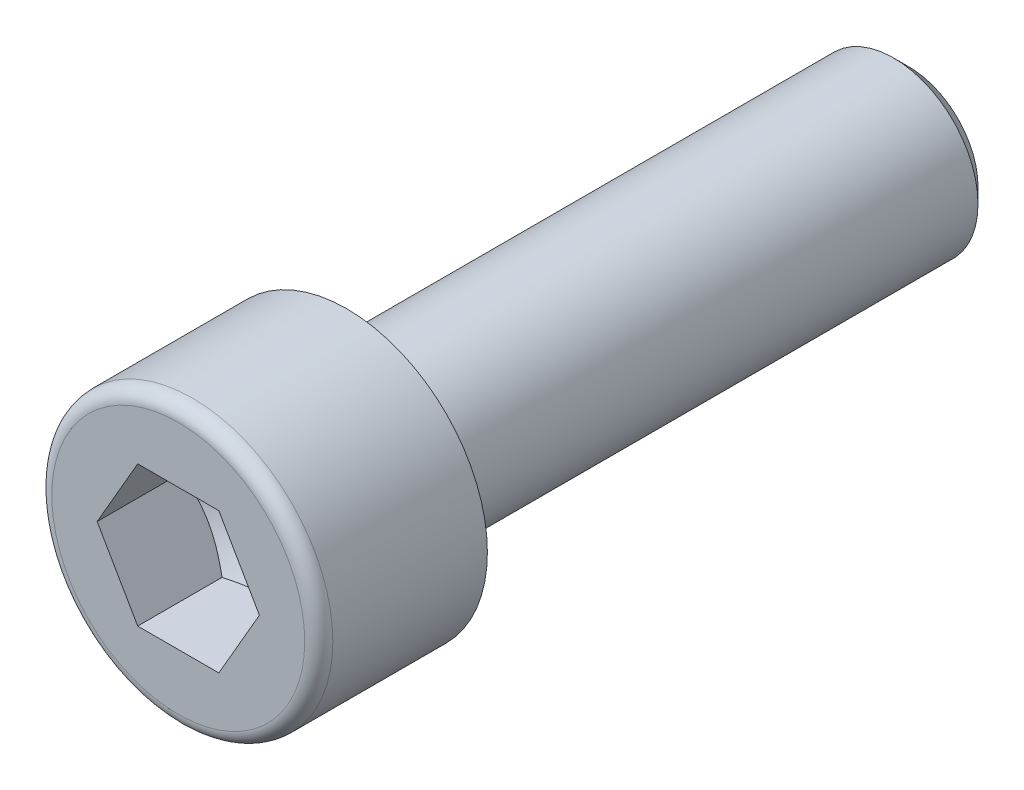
ISO-10303-21;
HEADER;
FILE_DESCRIPTION(('STEP AP214'),'2;1');
FILE_NAME('part.step','',(''),(''),'','','');
FILE_SCHEMA(('AUTOMOTIVE_DESIGN { 1 0 10303 214 1 1 1 1 }'));
ENDSEC;
DATA;
#1=APPLICATION_CONTEXT('core data for automotive mechanical design processes');
#2=APPLICATION_PROTOCOL_DEFINITION('international standard','automotive_design',2000,#1);
#3=PRODUCT_CONTEXT('',#1,'mechanical');
#4=PRODUCT('Part','Part','',(#3));
#5=PRODUCT_RELATED_PRODUCT_CATEGORY('part','',(#4));
#6=PRODUCT_DEFINITION_FORMATION('','',#4);
#7=PRODUCT_DEFINITION_CONTEXT('part definition',#1,'design');
#8=PRODUCT_DEFINITION('design','',#6,#7);
#9=PRODUCT_DEFINITION_SHAPE('','',#8);
#10=(LENGTH_UNIT() NAMED_UNIT(*) SI_UNIT(.MILLI.,.METRE.));
#11=(NAMED_UNIT(*) PLANE_ANGLE_UNIT() SI_UNIT($,.RADIAN.));
#12=(NAMED_UNIT(*) SI_UNIT($,.STERADIAN.) SOLID_ANGLE_UNIT());
#13=UNCERTAINTY_MEASURE_WITH_UNIT(LENGTH_MEASURE(1.E-05),#10,'distance_accuracy_value','');
#14=(GEOMETRIC_REPRESENTATION_CONTEXT(3) GLOBAL_UNCERTAINTY_ASSIGNED_CONTEXT((#13)) GLOBAL_UNIT_ASSIGNED_CONTEXT((#10,
#11,#12)) REPRESENTATION_CONTEXT('',''));
#15=CARTESIAN_POINT('',(0.,0.,0.));
#16=DIRECTION('',(0.,0.,1.));
#17=DIRECTION('',(1.,0.,0.));
#18=AXIS2_PLACEMENT_3D('',#15,#16,#17);
#19=CARTESIAN_POINT('',(0.,0.,6.));
#20=DIRECTION('',(0.,0.,1.));
#21=DIRECTION('',(1.,0.,0.));
#22=AXIS2_PLACEMENT_3D('',#19,#20,#21);
#23=PLANE('',#22);
#24=CARTESIAN_POINT('',(0.,0.,6.));
#25=DIRECTION('',(0.,0.,1.));
#26=DIRECTION('',(1.,0.,0.));
#27=AXIS2_PLACEMENT_3D('',#24,#25,#26);
#28=CIRCLE('',#27,4.5);
#29=CARTESIAN_POINT('',(4.5,0.,6.));
#30=VERTEX_POINT('',#29);
#31=EDGE_CURVE('E11',#30,#30,#28,.T.);
#32=ORIENTED_EDGE('',*,*,#31,.T.);
#33=EDGE_LOOP('',(#32));
#34=FACE_BOUND('',#33,.T.);
#35=DIRECTION('',(1.,0.,0.));
#36=VECTOR('',#35,1.);
#37=CARTESIAN_POINT('',(-1.443375,2.49999883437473,6.));
#38=LINE('',#37,#36);
#39=CARTESIAN_POINT('',(-1.443375,2.49999883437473,6.));
#40=VERTEX_POINT('',#39);
#41=CARTESIAN_POINT('',(1.443375,2.49999883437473,6.));
#42=VERTEX_POINT('',#41);
#43=EDGE_CURVE('E91',#40,#42,#38,.T.);
#44=ORIENTED_EDGE('',*,*,#43,.T.);
#45=DIRECTION('',(0.5,-0.866025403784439,0.));
#46=VECTOR('',#45,1.);
#47=CARTESIAN_POINT('',(1.443375,2.49999883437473,6.));
#48=LINE('',#47,#46);
#49=CARTESIAN_POINT('',(2.88675,0.,6.));
#50=VERTEX_POINT('',#49);
#51=EDGE_CURVE('E30',#42,#50,#48,.T.);
#52=ORIENTED_EDGE('',*,*,#51,.T.);
#53=DIRECTION('',(-0.5,-0.866025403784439,0.));
#54=VECTOR('',#53,1.);
#55=CARTESIAN_POINT('',(2.88675,0.,6.));
#56=LINE('',#55,#54);
#57=CARTESIAN_POINT('',(1.443375,-2.49999883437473,6.));
#58=VERTEX_POINT('',#57);
#59=EDGE_CURVE('E171',#50,#58,#56,.T.);
#60=ORIENTED_EDGE('',*,*,#59,.T.);
#61=DIRECTION('',(-1.,0.,0.));
#62=VECTOR('',#61,1.);
#63=CARTESIAN_POINT('',(1.443375,-2.49999883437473,6.));
#64=LINE('',#63,#62);
#65=CARTESIAN_POINT('',(-1.443375,-2.49999883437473,6.));
#66=VERTEX_POINT('',#65);
#67=EDGE_CURVE('E167',#58,#66,#64,.T.);
#68=ORIENTED_EDGE('',*,*,#67,.T.);
#69=DIRECTION('',(-0.5,0.866025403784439,0.));
#70=VECTOR('',#69,1.);
#71=CARTESIAN_POINT('',(-1.443375,-2.49999883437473,6.));
#72=LINE('',#71,#70);
#73=CARTESIAN_POINT('',(-2.88675,0.,6.));
#74=VERTEX_POINT('',#73);
#75=EDGE_CURVE('E162',#66,#74,#72,.T.);
#76=ORIENTED_EDGE('',*,*,#75,.T.);
#77=DIRECTION('',(0.5,0.866025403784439,0.));
#78=VECTOR('',#77,1.);
#79=CARTESIAN_POINT('',(-2.88675,0.,6.));
#80=LINE('',#79,#78);
#81=EDGE_CURVE('E95',#74,#40,#80,.T.);
#82=ORIENTED_EDGE('',*,*,#81,.T.);
#83=EDGE_LOOP('',(#44,#52,#60,#68,#76,#82));
#84=FACE_BOUND('',#83,.T.);
#85=ADVANCED_FACE('F16',(#34,#84),#23,.T.);
#86=CARTESIAN_POINT('',(0.,0.,5.5));
#87=DIRECTION('',(0.,0.,1.));
#88=DIRECTION('',(1.,0.,0.));
#89=AXIS2_PLACEMENT_3D('',#86,#87,#88);
#90=TOROIDAL_SURFACE('',#89,4.5,0.5);
#91=ORIENTED_EDGE('',*,*,#31,.F.);
#92=EDGE_LOOP('',(#91));
#93=FACE_BOUND('',#92,.T.);
#94=CARTESIAN_POINT('',(0.,0.,5.5));
#95=DIRECTION('',(0.,0.,1.));
#96=DIRECTION('',(1.,0.,0.));
#97=AXIS2_PLACEMENT_3D('',#94,#95,#96);
#98=CIRCLE('',#97,5.);
#99=CARTESIAN_POINT('',(5.,0.,5.5));
#100=VERTEX_POINT('',#99);
#101=EDGE_CURVE('E23',#100,#100,#98,.T.);
#102=ORIENTED_EDGE('',*,*,#101,.T.);
#103=EDGE_LOOP('',(#102));
#104=FACE_BOUND('',#103,.T.);
#105=ADVANCED_FACE('F132',(#93,#104),#90,.T.);
#106=CARTESIAN_POINT('',(0.,0.,6.));
#107=DIRECTION('',(0.,0.,1.));
#108=DIRECTION('',(1.,0.,0.));
#109=AXIS2_PLACEMENT_3D('',#106,#107,#108);
#110=CYLINDRICAL_SURFACE('',#109,5.);
#111=CARTESIAN_POINT('',(0.,0.,0.));
#112=DIRECTION('',(0.,0.,1.));
#113=DIRECTION('',(1.,0.,0.));
#114=AXIS2_PLACEMENT_3D('',#111,#112,#113);
#115=CIRCLE('',#114,5.);
#116=CARTESIAN_POINT('',(5.,0.,0.));
#117=VERTEX_POINT('',#116);
#118=EDGE_CURVE('E127',#117,#117,#115,.T.);
#119=ORIENTED_EDGE('',*,*,#118,.T.);
#120=EDGE_LOOP('',(#119));
#121=FACE_BOUND('',#120,.T.);
#122=ORIENTED_EDGE('',*,*,#101,.F.);
#123=EDGE_LOOP('',(#122));
#124=FACE_BOUND('',#123,.T.);
#125=ADVANCED_FACE('F134',(#121,#124),#110,.T.);
#126=CARTESIAN_POINT('',(0.,5.,0.));
#127=DIRECTION('',(0.,0.,-1.));
#128=DIRECTION('',(-1.,0.,0.));
#129=AXIS2_PLACEMENT_3D('',#126,#127,#128);
#130=PLANE('',#129);
#131=CARTESIAN_POINT('',(0.,0.,0.));
#132=DIRECTION('',(0.,0.,1.));
#133=DIRECTION('',(1.,0.,0.));
#134=AXIS2_PLACEMENT_3D('',#131,#132,#133);
#135=CIRCLE('',#134,3.3);
#136=CARTESIAN_POINT('',(3.3,0.,0.));
#137=VERTEX_POINT('',#136);
#138=EDGE_CURVE('E124',#137,#137,#135,.T.);
#139=ORIENTED_EDGE('',*,*,#138,.T.);
#140=EDGE_LOOP('',(#139));
#141=FACE_BOUND('',#140,.T.);
#142=ORIENTED_EDGE('',*,*,#118,.F.);
#143=EDGE_LOOP('',(#142));
#144=FACE_BOUND('',#143,.T.);
#145=ADVANCED_FACE('F136',(#141,#144),#130,.T.);
#146=CARTESIAN_POINT('',(0.,0.,-0.3));
#147=DIRECTION('',(0.,0.,1.));
#148=DIRECTION('',(1.,0.,0.));
#149=AXIS2_PLACEMENT_3D('',#146,#147,#148);
#150=TOROIDAL_SURFACE('',#149,3.3,0.3);
#151=CARTESIAN_POINT('',(0.,0.,-0.3));
#152=DIRECTION('',(0.,0.,1.));
#153=DIRECTION('',(1.,0.,0.));
#154=AXIS2_PLACEMENT_3D('',#151,#152,#153);
#155=CIRCLE('',#154,3.);
#156=CARTESIAN_POINT('',(3.,0.,-0.3));
#157=VERTEX_POINT('',#156);
#158=EDGE_CURVE('E121',#157,#157,#155,.T.);
#159=ORIENTED_EDGE('',*,*,#158,.T.);
#160=EDGE_LOOP('',(#159));
#161=FACE_BOUND('',#160,.T.);
#162=ORIENTED_EDGE('',*,*,#138,.F.);
#163=EDGE_LOOP('',(#162));
#164=FACE_BOUND('',#163,.T.);
#165=ADVANCED_FACE('F144',(#161,#164),#150,.F.);
#166=CARTESIAN_POINT('',(0.,0.,6.));
#167=DIRECTION('',(0.,0.,1.));
#168=DIRECTION('',(1.,0.,0.));
#169=AXIS2_PLACEMENT_3D('',#166,#167,#168);
#170=CYLINDRICAL_SURFACE('',#169,3.);
#171=CARTESIAN_POINT('',(0.,0.,-0.301));
#172=DIRECTION('',(0.,0.,1.));
#173=DIRECTION('',(1.,0.,0.));
#174=AXIS2_PLACEMENT_3D('',#171,#172,#173);
#175=CIRCLE('',#174,3.);
#176=CARTESIAN_POINT('',(3.,0.,-0.301));
#177=VERTEX_POINT('',#176);
#178=EDGE_CURVE('E118',#177,#177,#175,.T.);
#179=ORIENTED_EDGE('',*,*,#178,.T.);
#180=EDGE_LOOP('',(#179));
#181=FACE_BOUND('',#180,.T.);
#182=ORIENTED_EDGE('',*,*,#158,.F.);
#183=EDGE_LOOP('',(#182));
#184=FACE_BOUND('',#183,.T.);
#185=ADVANCED_FACE('F289',(#181,#184),#170,.T.);
#186=CARTESIAN_POINT('',(0.,0.,-0.301));
#187=DIRECTION('',(0.,0.,1.));
#188=DIRECTION('',(1.,0.,0.));
#189=AXIS2_PLACEMENT_3D('',#186,#187,#188);
#190=CONICAL_SURFACE('',#189,3.,0.523598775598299);
#191=CARTESIAN_POINT('',(0.,0.,-1.23847249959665));
#192=DIRECTION('',(0.,0.,1.));
#193=DIRECTION('',(1.,0.,0.));
#194=AXIS2_PLACEMENT_3D('',#191,#192,#193);
#195=CIRCLE('',#194,2.45875);
#196=CARTESIAN_POINT('',(2.45875,0.,-1.23847249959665));
#197=VERTEX_POINT('',#196);
#198=EDGE_CURVE('E115',#197,#197,#195,.T.);
#199=ORIENTED_EDGE('',*,*,#198,.T.);
#200=EDGE_LOOP('',(#199));
#201=FACE_BOUND('',#200,.T.);
#202=ORIENTED_EDGE('',*,*,#178,.F.);
#203=EDGE_LOOP('',(#202));
#204=FACE_BOUND('',#203,.T.);
#205=ADVANCED_FACE('F280',(#201,#204),#190,.T.);
#206=CARTESIAN_POINT('',(0.,2.45875,-1.23847249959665));
#207=DIRECTION('',(0.,0.,1.));
#208=DIRECTION('',(1.,0.,0.));
#209=AXIS2_PLACEMENT_3D('',#206,#207,#208);
#210=PLANE('',#209);
#211=CARTESIAN_POINT('',(0.,0.,-1.23847249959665));
#212=DIRECTION('',(0.,0.,1.));
#213=DIRECTION('',(1.,0.,0.));
#214=AXIS2_PLACEMENT_3D('',#211,#212,#213);
#215=CIRCLE('',#214,3.);
#216=CARTESIAN_POINT('',(3.,0.,-1.23847249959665));
#217=VERTEX_POINT('',#216);
#218=EDGE_CURVE('E112',#217,#217,#215,.T.);
#219=ORIENTED_EDGE('',*,*,#218,.T.);
#220=EDGE_LOOP('',(#219));
#221=FACE_BOUND('',#220,.T.);
#222=ORIENTED_EDGE('',*,*,#198,.F.);
#223=EDGE_LOOP('',(#222));
#224=FACE_BOUND('',#223,.T.);
#225=ADVANCED_FACE('F271',(#221,#224),#210,.T.);
#226=CARTESIAN_POINT('',(0.,0.,6.));
#227=DIRECTION('',(0.,0.,1.));
#228=DIRECTION('',(1.,0.,0.));
#229=AXIS2_PLACEMENT_3D('',#226,#227,#228);
#230=CYLINDRICAL_SURFACE('',#229,3.);
#231=CARTESIAN_POINT('',(0.,0.,-19.45875));
#232=DIRECTION('',(0.,0.,1.));
#233=DIRECTION('',(1.,0.,0.));
#234=AXIS2_PLACEMENT_3D('',#231,#232,#233);
#235=CIRCLE('',#234,3.);
#236=CARTESIAN_POINT('',(3.,0.,-19.45875));
#237=VERTEX_POINT('',#236);
#238=EDGE_CURVE('E109',#237,#237,#235,.T.);
#239=ORIENTED_EDGE('',*,*,#238,.T.);
#240=EDGE_LOOP('',(#239));
#241=FACE_BOUND('',#240,.T.);
#242=ORIENTED_EDGE('',*,*,#218,.F.);
#243=EDGE_LOOP('',(#242));
#244=FACE_BOUND('',#243,.T.);
#245=ADVANCED_FACE('F262',(#241,#244),#230,.T.);
#246=CARTESIAN_POINT('',(0.,0.,-19.45875));
#247=DIRECTION('',(0.,0.,1.));
#248=DIRECTION('',(1.,0.,0.));
#249=AXIS2_PLACEMENT_3D('',#246,#247,#248);
#250=CONICAL_SURFACE('',#249,3.,0.78539816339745);
#251=CARTESIAN_POINT('',(0.,0.,-20.));
#252=DIRECTION('',(0.,0.,1.));
#253=DIRECTION('',(1.,0.,0.));
#254=AXIS2_PLACEMENT_3D('',#251,#252,#253);
#255=CIRCLE('',#254,2.45875);
#256=CARTESIAN_POINT('',(2.45875,0.,-20.));
#257=VERTEX_POINT('',#256);
#258=EDGE_CURVE('E106',#257,#257,#255,.T.);
#259=ORIENTED_EDGE('',*,*,#258,.T.);
#260=EDGE_LOOP('',(#259));
#261=FACE_BOUND('',#260,.T.);
#262=ORIENTED_EDGE('',*,*,#238,.F.);
#263=EDGE_LOOP('',(#262));
#264=FACE_BOUND('',#263,.T.);
#265=ADVANCED_FACE('F254',(#261,#264),#250,.T.);
#266=CARTESIAN_POINT('',(0.,2.45875,-20.));
#267=DIRECTION('',(0.,0.,-1.));
#268=DIRECTION('',(-1.,0.,0.));
#269=AXIS2_PLACEMENT_3D('',#266,#267,#268);
#270=PLANE('',#269);
#271=ORIENTED_EDGE('',*,*,#258,.F.);
#272=EDGE_LOOP('',(#271));
#273=FACE_BOUND('',#272,.T.);
#274=ADVANCED_FACE('F227',(#273),#270,.T.);
#275=CARTESIAN_POINT('',(1.443375,2.49999883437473,1.33333411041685));
#276=DIRECTION('',(-0.866025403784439,-0.5,0.));
#277=DIRECTION('',(-0.5,0.866025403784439,0.));
#278=AXIS2_PLACEMENT_3D('',#275,#276,#277);
#279=PLANE('',#278);
#280=DIRECTION('',(0.,0.,1.));
#281=VECTOR('',#280,1.);
#282=CARTESIAN_POINT('',(2.88675,0.,1.33333411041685));
#283=LINE('',#282,#281);
#284=CARTESIAN_POINT('',(2.88675,0.,3.));
#285=VERTEX_POINT('',#284);
#286=EDGE_CURVE('E104',#285,#50,#283,.T.);
#287=ORIENTED_EDGE('',*,*,#286,.T.);
#288=ORIENTED_EDGE('',*,*,#51,.F.);
#289=DIRECTION('',(0.,0.,1.));
#290=VECTOR('',#289,1.);
#291=CARTESIAN_POINT('',(1.443375,2.49999883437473,1.33333411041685));
#292=LINE('',#291,#290);
#293=CARTESIAN_POINT('',(1.443375,2.49999883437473,3.));
#294=VERTEX_POINT('',#293);
#295=EDGE_CURVE('E85',#294,#42,#292,.T.);
#296=ORIENTED_EDGE('',*,*,#295,.F.);
#297=CARTESIAN_POINT('',(2.88675011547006,-1.99999999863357E-07,3.00000006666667));
#298=CARTESIAN_POINT('',(2.82332252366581,0.10985961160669,2.96336950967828));
#299=CARTESIAN_POINT('',(2.75934742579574,0.220667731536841,2.93005593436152));
#300=CARTESIAN_POINT('',(2.63028954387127,0.444202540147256,2.87190808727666));
#301=CARTESIAN_POINT('',(2.56520446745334,0.556933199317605,2.84709438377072));
#302=CARTESIAN_POINT('',(2.43584088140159,0.780997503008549,2.80847006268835));
#303=CARTESIAN_POINT('',(2.37158227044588,0.892296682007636,2.7944023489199));
#304=CARTESIAN_POINT('',(2.24276284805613,1.11541846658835,2.77761157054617));
#305=CARTESIAN_POINT('',(2.17820250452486,1.22724026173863,2.77487459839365));
#306=CARTESIAN_POINT('',(2.05757841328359,1.43616731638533,2.78058295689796));
#307=CARTESIAN_POINT('',(2.00149656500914,1.53330392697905,2.7876266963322));
#308=CARTESIAN_POINT('',(1.8896982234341,1.72694433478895,2.80994670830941));
#309=CARTESIAN_POINT('',(1.83398211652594,1.82344746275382,2.82523059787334));
#310=CARTESIAN_POINT('',(1.72195345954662,2.01748678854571,2.86343736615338));
#311=CARTESIAN_POINT('',(1.66565508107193,2.11499844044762,2.88652212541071));
#312=CARTESIAN_POINT('',(1.55389777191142,2.3085677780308,2.93891477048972));
#313=CARTESIAN_POINT('',(1.49843741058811,2.40462794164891,2.96821035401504));
#314=CARTESIAN_POINT('',(1.44337488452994,2.49999903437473,3.00000006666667));
#315=B_SPLINE_CURVE_WITH_KNOTS('',3,(#297,#298,#299,#300,#301,#302,#303,#304,#305,#306,#307,
#308,#309,#310,#311,#312,#313,#314),.UNSPECIFIED.,.F.,.F.,(4,2,2,2,2,2,2,2,4),(0.,
0.396269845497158,0.793491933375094,1.18088400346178,1.56780044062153,1.90463400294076,
2.24177946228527,2.58640119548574,2.93034658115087),.UNSPECIFIED.);
#316=EDGE_CURVE('E78',#285,#294,#315,.T.);
#317=ORIENTED_EDGE('',*,*,#316,.F.);
#318=EDGE_LOOP('',(#287,#288,#296,#317));
#319=FACE_BOUND('',#318,.T.);
#320=ADVANCED_FACE('F86',(#319),#279,.T.);
#321=CARTESIAN_POINT('',(2.88675,0.,1.33333411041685));
#322=DIRECTION('',(-0.866025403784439,0.5,0.));
#323=DIRECTION('',(0.5,0.866025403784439,0.));
#324=AXIS2_PLACEMENT_3D('',#321,#322,#323);
#325=PLANE('',#324);
#326=DIRECTION('',(0.,0.,1.));
#327=VECTOR('',#326,1.);
#328=CARTESIAN_POINT('',(1.443375,-2.49999883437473,1.33333411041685));
#329=LINE('',#328,#327);
#330=CARTESIAN_POINT('',(1.443375,-2.49999883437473,3.));
#331=VERTEX_POINT('',#330);
#332=EDGE_CURVE('E102',#331,#58,#329,.T.);
#333=ORIENTED_EDGE('',*,*,#332,.T.);
#334=ORIENTED_EDGE('',*,*,#59,.F.);
#335=ORIENTED_EDGE('',*,*,#286,.F.);
#336=CARTESIAN_POINT('',(1.44337488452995,-2.49999903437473,3.00000006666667));
#337=CARTESIAN_POINT('',(1.50680247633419,-2.39013922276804,2.96336950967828));
#338=CARTESIAN_POINT('',(1.57077757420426,-2.27933110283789,2.93005593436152));
#339=CARTESIAN_POINT('',(1.69983545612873,-2.05579629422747,2.87190808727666));
#340=CARTESIAN_POINT('',(1.76492053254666,-1.94306563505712,2.84709438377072));
#341=CARTESIAN_POINT('',(1.89428411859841,-1.71900133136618,2.80847006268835));
#342=CARTESIAN_POINT('',(1.95854272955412,-1.60770215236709,2.7944023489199));
#343=CARTESIAN_POINT('',(2.08736215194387,-1.38458036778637,2.77761157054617));
#344=CARTESIAN_POINT('',(2.15192249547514,-1.2727585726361,2.77487459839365));
#345=CARTESIAN_POINT('',(2.27254658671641,-1.06383151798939,2.78058295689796));
#346=CARTESIAN_POINT('',(2.32862843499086,-0.96669490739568,2.7876266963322));
#347=CARTESIAN_POINT('',(2.4404267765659,-0.773054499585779,2.8099467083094));
#348=CARTESIAN_POINT('',(2.49614288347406,-0.676551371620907,2.82523059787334));
#349=CARTESIAN_POINT('',(2.60817154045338,-0.48251204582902,2.86343736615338));
#350=CARTESIAN_POINT('',(2.66446991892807,-0.385000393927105,2.88652212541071));
#351=CARTESIAN_POINT('',(2.77622722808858,-0.191431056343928,2.93891477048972));
#352=CARTESIAN_POINT('',(2.83168758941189,-0.0953708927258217,2.96821035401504));
#353=CARTESIAN_POINT('',(2.88675011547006,1.99999999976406E-07,3.00000006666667));
#354=B_SPLINE_CURVE_WITH_KNOTS('',3,(#336,#337,#338,#339,#340,#341,#342,#343,#344,#345,#346,
#347,#348,#349,#350,#351,#352,#353),.UNSPECIFIED.,.F.,.F.,(4,2,2,2,2,2,2,2,4),(0.,
0.396269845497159,0.793491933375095,1.18088400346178,1.56780044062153,1.90463400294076,
2.24177946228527,2.58640119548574,2.93034658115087),.UNSPECIFIED.);
#355=EDGE_CURVE('E82',#331,#285,#354,.T.);
#356=ORIENTED_EDGE('',*,*,#355,.F.);
#357=EDGE_LOOP('',(#333,#334,#335,#356));
#358=FACE_BOUND('',#357,.T.);
#359=ADVANCED_FACE('F217',(#358),#325,.T.);
#360=CARTESIAN_POINT('',(1.443375,-2.49999883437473,1.33333411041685));
#361=DIRECTION('',(0.,1.,0.));
#362=DIRECTION('',(1.,0.,0.));
#363=AXIS2_PLACEMENT_3D('',#360,#361,#362);
#364=PLANE('',#363);
#365=DIRECTION('',(0.,0.,1.));
#366=VECTOR('',#365,1.);
#367=CARTESIAN_POINT('',(-1.443375,-2.49999883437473,1.33333411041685));
#368=LINE('',#367,#366);
#369=CARTESIAN_POINT('',(-1.443375,-2.49999883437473,3.));
#370=VERTEX_POINT('',#369);
#371=EDGE_CURVE('E100',#370,#66,#368,.T.);
#372=ORIENTED_EDGE('',*,*,#371,.T.);
#373=ORIENTED_EDGE('',*,*,#67,.F.);
#374=ORIENTED_EDGE('',*,*,#332,.F.);
#375=CARTESIAN_POINT('',(-3.73786106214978,-2.49999883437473,3.92958778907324));
#376=CARTESIAN_POINT('',(-3.62896491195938,-2.49999883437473,3.87734398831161));
#377=CARTESIAN_POINT('',(-3.51980131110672,-2.49999883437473,3.82564701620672));
#378=CARTESIAN_POINT('',(-3.30079453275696,-2.49999883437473,3.72366066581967));
#379=CARTESIAN_POINT('',(-3.19095123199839,-2.49999883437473,3.67337155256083));
#380=CARTESIAN_POINT('',(-2.96980741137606,-2.49999883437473,3.57423266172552));
#381=CARTESIAN_POINT('',(-2.85850208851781,-2.49999883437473,3.5253935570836));
#382=CARTESIAN_POINT('',(-2.63494533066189,-2.49999883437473,3.42993961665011));
#383=CARTESIAN_POINT('',(-2.52269394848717,-2.49999883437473,3.38332465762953));
#384=CARTESIAN_POINT('',(-2.2960796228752,-2.49999883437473,3.29252281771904));
#385=CARTESIAN_POINT('',(-2.18170681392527,-2.49999883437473,3.2483604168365));
#386=CARTESIAN_POINT('',(-1.95158478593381,-2.49999883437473,3.16370836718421));
#387=CARTESIAN_POINT('',(-1.83583541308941,-2.49999883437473,3.12321913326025));
#388=CARTESIAN_POINT('',(-1.60304799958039,-2.49999883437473,3.04706130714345));
#389=CARTESIAN_POINT('',(-1.4860136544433,-2.49999883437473,3.01138153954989));
#390=CARTESIAN_POINT('',(-1.25028155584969,-2.49999883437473,2.94604587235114));
#391=CARTESIAN_POINT('',(-1.13158421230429,-2.49999883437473,2.91638851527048));
#392=CARTESIAN_POINT('',(-0.892146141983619,-2.49999883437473,2.86451911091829));
#393=CARTESIAN_POINT('',(-0.771400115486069,-2.49999883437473,2.84233105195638));
#394=CARTESIAN_POINT('',(-0.528550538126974,-2.49999883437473,2.8070567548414));
#395=CARTESIAN_POINT('',(-0.406446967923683,-2.49999883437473,2.7939706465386));
#396=CARTESIAN_POINT('',(-0.162227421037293,-2.49999883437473,2.77805851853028));
#397=CARTESIAN_POINT('',(-0.0401151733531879,-2.49999883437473,2.77517671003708));
#398=CARTESIAN_POINT('',(0.203885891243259,-2.49999883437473,2.77978959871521));
#399=CARTESIAN_POINT('',(0.325774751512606,-2.49999883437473,2.78728200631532));
#400=CARTESIAN_POINT('',(0.536617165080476,-2.49999883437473,2.80870547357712));
#401=CARTESIAN_POINT('',(0.625806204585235,-2.49999883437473,2.82042640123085));
#402=CARTESIAN_POINT('',(0.803437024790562,-2.49999883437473,2.84861382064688));
#403=CARTESIAN_POINT('',(0.891878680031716,-2.49999883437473,2.86508109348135));
#404=CARTESIAN_POINT('',(1.1562492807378,-2.49999883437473,2.92077504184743));
#405=CARTESIAN_POINT('',(1.3308708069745,-2.49999883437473,2.96625356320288));
#406=CARTESIAN_POINT('',(1.59190160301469,-2.49999883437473,3.04393162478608));
#407=CARTESIAN_POINT('',(1.67969059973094,-2.49999883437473,3.0717495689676));
#408=CARTESIAN_POINT('',(1.85442096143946,-2.49999883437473,3.12997740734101));
#409=CARTESIAN_POINT('',(1.94136225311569,-2.49999883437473,3.16038752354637));
#410=CARTESIAN_POINT('',(2.1139610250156,-2.49999883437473,3.22316216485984));
#411=CARTESIAN_POINT('',(2.19962301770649,-2.49999883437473,3.25551440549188));
#412=CARTESIAN_POINT('',(2.37023194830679,-2.49999883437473,3.32197432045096));
#413=CARTESIAN_POINT('',(2.45517911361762,-2.49999883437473,3.35608140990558));
#414=CARTESIAN_POINT('',(2.53982745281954,-2.49999883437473,3.3908988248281));
#415=B_SPLINE_CURVE_WITH_KNOTS('',3,(#375,#376,#377,#378,#379,#380,#381,#382,#383,#384,#385,
#386,#387,#388,#389,#390,#391,#392,#393,#394,#395,#396,#397,#398,#399,#400,#401,#402,#403,#404,
#405,#406,#407,#408,#409,#410,#411,#412,#413,#414),.UNSPECIFIED.,.F.,.F.,(4,2,2,2,2,2,2,2,2,2,2,
2,2,2,2,2,2,2,2,4),(0.,0.362345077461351,0.724757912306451,1.08938530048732,1.45399246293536,
1.82175226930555,2.18955355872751,2.55648491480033,2.92332736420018,3.29133696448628,
3.65935181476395,4.02535152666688,4.39127047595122,4.66100477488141,4.93078348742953,
5.47140222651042,5.74765583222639,6.02393312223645,6.29861688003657,6.57320967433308),.UNSPECIFIED.);
#416=EDGE_CURVE('E209',#370,#331,#415,.T.);
#417=ORIENTED_EDGE('',*,*,#416,.F.);
#418=EDGE_LOOP('',(#372,#373,#374,#417));
#419=FACE_BOUND('',#418,.T.);
#420=ADVANCED_FACE('F214',(#419),#364,.T.);
#421=CARTESIAN_POINT('',(-1.443375,-2.49999883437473,1.33333411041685));
#422=DIRECTION('',(0.866025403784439,0.5,0.));
#423=DIRECTION('',(0.5,-0.866025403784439,0.));
#424=AXIS2_PLACEMENT_3D('',#421,#422,#423);
#425=PLANE('',#424);
#426=DIRECTION('',(0.,0.,1.));
#427=VECTOR('',#426,1.);
#428=CARTESIAN_POINT('',(-2.88675,0.,1.33333411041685));
#429=LINE('',#428,#427);
#430=CARTESIAN_POINT('',(-2.88675,0.,3.));
#431=VERTEX_POINT('',#430);
#432=EDGE_CURVE('E93',#431,#74,#429,.T.);
#433=ORIENTED_EDGE('',*,*,#432,.T.);
#434=ORIENTED_EDGE('',*,*,#75,.F.);
#435=ORIENTED_EDGE('',*,*,#371,.F.);
#436=CARTESIAN_POINT('',(-2.88675011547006,2.E-07,3.00000006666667));
#437=CARTESIAN_POINT('',(-2.82332252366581,-0.109859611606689,2.96336950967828));
#438=CARTESIAN_POINT('',(-2.75934742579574,-0.220667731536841,2.93005593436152));
#439=CARTESIAN_POINT('',(-2.63028954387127,-0.444202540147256,2.87190808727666));
#440=CARTESIAN_POINT('',(-2.56520446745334,-0.556933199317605,2.84709438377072));
#441=CARTESIAN_POINT('',(-2.43584088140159,-0.78099750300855,2.80847006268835));
#442=CARTESIAN_POINT('',(-2.37158227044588,-0.892296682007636,2.7944023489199));
#443=CARTESIAN_POINT('',(-2.24276284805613,-1.11541846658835,2.77761157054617));
#444=CARTESIAN_POINT('',(-2.17820250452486,-1.22724026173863,2.77487459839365));
#445=CARTESIAN_POINT('',(-2.05757841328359,-1.43616731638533,2.78058295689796));
#446=CARTESIAN_POINT('',(-2.00149656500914,-1.53330392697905,2.7876266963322));
#447=CARTESIAN_POINT('',(-1.8896982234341,-1.72694433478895,2.80994670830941));
#448=CARTESIAN_POINT('',(-1.83398211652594,-1.82344746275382,2.82523059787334));
#449=CARTESIAN_POINT('',(-1.72195345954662,-2.01748678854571,2.86343736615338));
#450=CARTESIAN_POINT('',(-1.66565508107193,-2.11499844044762,2.88652212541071));
#451=CARTESIAN_POINT('',(-1.55389777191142,-2.3085677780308,2.93891477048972));
#452=CARTESIAN_POINT('',(-1.49843741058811,-2.40462794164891,2.96821035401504));
#453=CARTESIAN_POINT('',(-1.44337488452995,-2.49999903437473,3.00000006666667));
#454=B_SPLINE_CURVE_WITH_KNOTS('',3,(#436,#437,#438,#439,#440,#441,#442,#443,#444,#445,#446,
#447,#448,#449,#450,#451,#452,#453),.UNSPECIFIED.,.F.,.F.,(4,2,2,2,2,2,2,2,4),(0.,
0.396269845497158,0.793491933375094,1.18088400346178,1.56780044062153,1.90463400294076,
2.24177946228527,2.58640119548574,2.93034658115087),.UNSPECIFIED.);
#455=EDGE_CURVE('E204',#431,#370,#454,.T.);
#456=ORIENTED_EDGE('',*,*,#455,.F.);
#457=EDGE_LOOP('',(#433,#434,#435,#456));
#458=FACE_BOUND('',#457,.T.);
#459=ADVANCED_FACE('F216',(#458),#425,.T.);
#460=CARTESIAN_POINT('',(-2.88675,0.,1.33333411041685));
#461=DIRECTION('',(0.866025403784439,-0.5,0.));
#462=DIRECTION('',(-0.5,-0.866025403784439,0.));
#463=AXIS2_PLACEMENT_3D('',#460,#461,#462);
#464=PLANE('',#463);
#465=DIRECTION('',(0.,0.,1.));
#466=VECTOR('',#465,1.);
#467=CARTESIAN_POINT('',(-1.443375,2.49999883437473,1.33333411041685));
#468=LINE('',#467,#466);
#469=CARTESIAN_POINT('',(-1.443375,2.49999883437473,3.));
#470=VERTEX_POINT('',#469);
#471=EDGE_CURVE('E90',#470,#40,#468,.T.);
#472=ORIENTED_EDGE('',*,*,#471,.T.);
#473=ORIENTED_EDGE('',*,*,#81,.F.);
#474=ORIENTED_EDGE('',*,*,#432,.F.);
#475=CARTESIAN_POINT('',(-1.44337488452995,2.49999903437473,3.00000006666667));
#476=CARTESIAN_POINT('',(-1.50680247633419,2.39013922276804,2.96336950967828));
#477=CARTESIAN_POINT('',(-1.57077757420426,2.27933110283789,2.93005593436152));
#478=CARTESIAN_POINT('',(-1.69983545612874,2.05579629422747,2.87190808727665));
#479=CARTESIAN_POINT('',(-1.76492053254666,1.94306563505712,2.84709438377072));
#480=CARTESIAN_POINT('',(-1.89428411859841,1.71900133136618,2.80847006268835));
#481=CARTESIAN_POINT('',(-1.95854272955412,1.60770215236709,2.7944023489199));
#482=CARTESIAN_POINT('',(-2.08736215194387,1.38458036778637,2.77761157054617));
#483=CARTESIAN_POINT('',(-2.15192249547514,1.2727585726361,2.77487459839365));
#484=CARTESIAN_POINT('',(-2.27254658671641,1.06383151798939,2.78058295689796));
#485=CARTESIAN_POINT('',(-2.32862843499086,0.966694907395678,2.7876266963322));
#486=CARTESIAN_POINT('',(-2.4404267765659,0.773054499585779,2.8099467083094));
#487=CARTESIAN_POINT('',(-2.49614288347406,0.676551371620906,2.82523059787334));
#488=CARTESIAN_POINT('',(-2.60817154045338,0.48251204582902,2.86343736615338));
#489=CARTESIAN_POINT('',(-2.66446991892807,0.385000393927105,2.88652212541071));
#490=CARTESIAN_POINT('',(-2.77622722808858,0.191431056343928,2.93891477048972));
#491=CARTESIAN_POINT('',(-2.83168758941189,0.0953708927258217,2.96821035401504));
#492=CARTESIAN_POINT('',(-2.88675011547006,-2.00000000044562E-07,3.00000006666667));
#493=B_SPLINE_CURVE_WITH_KNOTS('',3,(#475,#476,#477,#478,#479,#480,#481,#482,#483,#484,#485,
#486,#487,#488,#489,#490,#491,#492),.UNSPECIFIED.,.F.,.F.,(4,2,2,2,2,2,2,2,4),(0.,
0.396269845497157,0.793491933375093,1.18088400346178,1.56780044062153,1.90463400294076,
2.24177946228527,2.58640119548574,2.93034658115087),.UNSPECIFIED.);
#494=EDGE_CURVE('E38',#470,#431,#493,.T.);
#495=ORIENTED_EDGE('',*,*,#494,.F.);
#496=EDGE_LOOP('',(#472,#473,#474,#495));
#497=FACE_BOUND('',#496,.T.);
#498=ADVANCED_FACE('F161',(#497),#464,.T.);
#499=CARTESIAN_POINT('',(-1.443375,2.49999883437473,1.33333411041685));
#500=DIRECTION('',(0.,-1.,0.));
#501=DIRECTION('',(-1.,0.,0.));
#502=AXIS2_PLACEMENT_3D('',#499,#500,#501);
#503=PLANE('',#502);
#504=ORIENTED_EDGE('',*,*,#295,.T.);
#505=ORIENTED_EDGE('',*,*,#43,.F.);
#506=ORIENTED_EDGE('',*,*,#471,.F.);
#507=CARTESIAN_POINT('',(-3.73786106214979,2.49999883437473,3.92958778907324));
#508=CARTESIAN_POINT('',(-3.62896491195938,2.49999883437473,3.87734398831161));
#509=CARTESIAN_POINT('',(-3.51980131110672,2.49999883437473,3.82564701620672));
#510=CARTESIAN_POINT('',(-3.30079453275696,2.49999883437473,3.72366066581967));
#511=CARTESIAN_POINT('',(-3.1909512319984,2.49999883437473,3.67337155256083));
#512=CARTESIAN_POINT('',(-2.96980741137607,2.49999883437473,3.57423266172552));
#513=CARTESIAN_POINT('',(-2.85850208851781,2.49999883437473,3.5253935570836));
#514=CARTESIAN_POINT('',(-2.6349453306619,2.49999883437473,3.42993961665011));
#515=CARTESIAN_POINT('',(-2.52269394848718,2.49999883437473,3.38332465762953));
#516=CARTESIAN_POINT('',(-2.2960796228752,2.49999883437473,3.29252281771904));
#517=CARTESIAN_POINT('',(-2.18170681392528,2.49999883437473,3.2483604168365));
#518=CARTESIAN_POINT('',(-1.95158478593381,2.49999883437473,3.16370836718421));
#519=CARTESIAN_POINT('',(-1.83583541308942,2.49999883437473,3.12321913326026));
#520=CARTESIAN_POINT('',(-1.60304799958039,2.49999883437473,3.04706130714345));
#521=CARTESIAN_POINT('',(-1.4860136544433,2.49999883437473,3.01138153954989));
#522=CARTESIAN_POINT('',(-1.2502815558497,2.49999883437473,2.94604587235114));
#523=CARTESIAN_POINT('',(-1.1315842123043,2.49999883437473,2.91638851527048));
#524=CARTESIAN_POINT('',(-0.892146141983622,2.49999883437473,2.86451911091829));
#525=CARTESIAN_POINT('',(-0.771400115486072,2.49999883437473,2.84233105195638));
#526=CARTESIAN_POINT('',(-0.528550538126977,2.49999883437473,2.8070567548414));
#527=CARTESIAN_POINT('',(-0.406446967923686,2.49999883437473,2.7939706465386));
#528=CARTESIAN_POINT('',(-0.162227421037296,2.49999883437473,2.77805851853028));
#529=CARTESIAN_POINT('',(-0.0401151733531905,2.49999883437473,2.77517671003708));
#530=CARTESIAN_POINT('',(0.203885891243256,2.49999883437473,2.77978959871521));
#531=CARTESIAN_POINT('',(0.325774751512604,2.49999883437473,2.78728200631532));
#532=CARTESIAN_POINT('',(0.536617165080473,2.49999883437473,2.80870547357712));
#533=CARTESIAN_POINT('',(0.625806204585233,2.49999883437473,2.82042640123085));
#534=CARTESIAN_POINT('',(0.80343702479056,2.49999883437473,2.84861382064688));
#535=CARTESIAN_POINT('',(0.891878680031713,2.49999883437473,2.86508109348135));
#536=CARTESIAN_POINT('',(1.1562492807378,2.49999883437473,2.92077504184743));
#537=CARTESIAN_POINT('',(1.3308708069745,2.49999883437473,2.96625356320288));
#538=CARTESIAN_POINT('',(1.59190160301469,2.49999883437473,3.04393162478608));
#539=CARTESIAN_POINT('',(1.67969059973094,2.49999883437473,3.0717495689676));
#540=CARTESIAN_POINT('',(1.85442096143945,2.49999883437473,3.12997740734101));
#541=CARTESIAN_POINT('',(1.94136225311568,2.49999883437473,3.16038752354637));
#542=CARTESIAN_POINT('',(2.1139610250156,2.49999883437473,3.22316216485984));
#543=CARTESIAN_POINT('',(2.19962301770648,2.49999883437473,3.25551440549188));
#544=CARTESIAN_POINT('',(2.37023194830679,2.49999883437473,3.32197432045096));
#545=CARTESIAN_POINT('',(2.45517911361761,2.49999883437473,3.35608140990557));
#546=CARTESIAN_POINT('',(2.53982745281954,2.49999883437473,3.3908988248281));
#547=B_SPLINE_CURVE_WITH_KNOTS('',3,(#507,#508,#509,#510,#511,#512,#513,#514,#515,#516,#517,
#518,#519,#520,#521,#522,#523,#524,#525,#526,#527,#528,#529,#530,#531,#532,#533,#534,#535,#536,
#537,#538,#539,#540,#541,#542,#543,#544,#545,#546),.UNSPECIFIED.,.F.,.F.,(4,2,2,2,2,2,2,2,2,2,2,
2,2,2,2,2,2,2,2,4),(0.,0.36234507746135,0.724757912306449,1.08938530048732,1.45399246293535,
1.82175226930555,2.18955355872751,2.55648491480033,2.92332736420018,3.29133696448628,
3.65935181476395,4.02535152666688,4.39127047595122,4.66100477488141,4.93078348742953,
5.47140222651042,5.74765583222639,6.02393312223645,6.29861688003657,6.57320967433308),.UNSPECIFIED.);
#548=EDGE_CURVE('E79',#294,#470,#547,.F.);
#549=ORIENTED_EDGE('',*,*,#548,.F.);
#550=EDGE_LOOP('',(#504,#505,#506,#549));
#551=FACE_BOUND('',#550,.T.);
#552=ADVANCED_FACE('F74',(#551),#503,.T.);
#553=CARTESIAN_POINT('',(0.,0.,1.33333411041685));
#554=DIRECTION('',(0.,0.,1.));
#555=DIRECTION('',(1.,0.,0.));
#556=AXIS2_PLACEMENT_3D('',#553,#554,#555);
#557=CONICAL_SURFACE('',#556,0.,1.0471975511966);
#558=CARTESIAN_POINT('',(0.,0.,1.33333411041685));
#559=VERTEX_POINT('',#558);
#560=VERTEX_LOOP('',#559);
#561=FACE_BOUND('',#560,.T.);
#562=ORIENTED_EDGE('',*,*,#316,.T.);
#563=ORIENTED_EDGE('',*,*,#548,.T.);
#564=ORIENTED_EDGE('',*,*,#494,.T.);
#565=ORIENTED_EDGE('',*,*,#455,.T.);
#566=ORIENTED_EDGE('',*,*,#416,.T.);
#567=ORIENTED_EDGE('',*,*,#355,.T.);
#568=EDGE_LOOP('',(#562,#563,#564,#565,#566,#567));
#569=FACE_BOUND('',#568,.T.);
#570=ADVANCED_FACE('F71',(#561,#569),#557,.F.);
#571=CLOSED_SHELL('',(#85,#105,#125,#145,#165,#185,#205,#225,#245,#265,#274,#320,#359,#420,#459,
#498,#552,#570));
#572=MANIFOLD_SOLID_BREP('B1',#571);
#573=ADVANCED_BREP_SHAPE_REPRESENTATION('',(#18,#572),#14);
#574=SHAPE_DEFINITION_REPRESENTATION(#9,#573);
ENDSEC;
END-ISO-10303-21;
